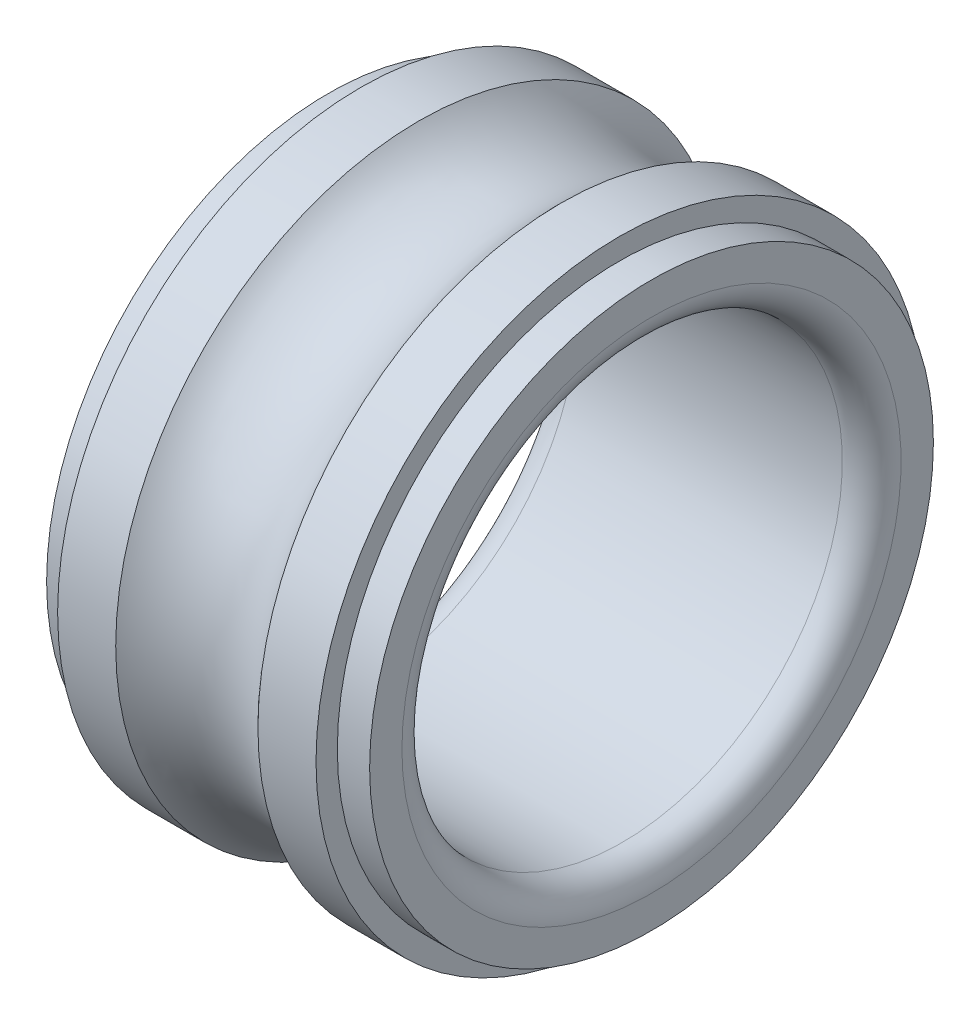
ISO-10303-21;
HEADER;
FILE_DESCRIPTION(('STEP AP214'),'2;1');
FILE_NAME('part.step','',(''),(''),'','','');
FILE_SCHEMA(('AUTOMOTIVE_DESIGN { 1 0 10303 214 1 1 1 1 }'));
ENDSEC;
DATA;
#1=APPLICATION_CONTEXT('core data for automotive mechanical design processes');
#2=APPLICATION_PROTOCOL_DEFINITION('international standard','automotive_design',2000,#1);
#3=PRODUCT_CONTEXT('',#1,'mechanical');
#4=PRODUCT('Part','Part','',(#3));
#5=PRODUCT_RELATED_PRODUCT_CATEGORY('part','',(#4));
#6=PRODUCT_DEFINITION_FORMATION('','',#4);
#7=PRODUCT_DEFINITION_CONTEXT('part definition',#1,'design');
#8=PRODUCT_DEFINITION('design','',#6,#7);
#9=PRODUCT_DEFINITION_SHAPE('','',#8);
#10=(LENGTH_UNIT() NAMED_UNIT(*) SI_UNIT(.MILLI.,.METRE.));
#11=(NAMED_UNIT(*) PLANE_ANGLE_UNIT() SI_UNIT($,.RADIAN.));
#12=(NAMED_UNIT(*) SI_UNIT($,.STERADIAN.) SOLID_ANGLE_UNIT());
#13=UNCERTAINTY_MEASURE_WITH_UNIT(LENGTH_MEASURE(1.E-05),#10,'distance_accuracy_value','');
#14=(GEOMETRIC_REPRESENTATION_CONTEXT(3) GLOBAL_UNCERTAINTY_ASSIGNED_CONTEXT((#13)) GLOBAL_UNIT_ASSIGNED_CONTEXT((#10,
#11,#12)) REPRESENTATION_CONTEXT('',''));
#15=CARTESIAN_POINT('',(0.,0.,0.));
#16=DIRECTION('',(0.,0.,1.));
#17=DIRECTION('',(1.,0.,0.));
#18=AXIS2_PLACEMENT_3D('',#15,#16,#17);
#19=CARTESIAN_POINT('',(4.4,10.325,0.));
#20=DIRECTION('',(-1.,0.,0.));
#21=DIRECTION('',(0.,0.,1.));
#22=AXIS2_PLACEMENT_3D('',#19,#20,#21);
#23=PLANE('',#22);
#24=CARTESIAN_POINT('',(4.4,0.,0.));
#25=DIRECTION('',(-1.,0.,0.));
#26=DIRECTION('',(0.,0.,1.));
#27=AXIS2_PLACEMENT_3D('',#24,#25,#26);
#28=CIRCLE('',#27,10.325);
#29=CARTESIAN_POINT('',(4.4,0.,10.325));
#30=VERTEX_POINT('',#29);
#31=EDGE_CURVE('E10',#30,#30,#28,.T.);
#32=ORIENTED_EDGE('',*,*,#31,.F.);
#33=EDGE_LOOP('',(#32));
#34=FACE_BOUND('',#33,.T.);
#35=CARTESIAN_POINT('',(4.4,0.,0.));
#36=DIRECTION('',(-1.,0.,0.));
#37=DIRECTION('',(0.,0.,1.));
#38=AXIS2_PLACEMENT_3D('',#35,#36,#37);
#39=CIRCLE('',#38,9.6);
#40=CARTESIAN_POINT('',(4.4,0.,9.6));
#41=VERTEX_POINT('',#40);
#42=EDGE_CURVE('E70',#41,#41,#39,.T.);
#43=ORIENTED_EDGE('',*,*,#42,.T.);
#44=EDGE_LOOP('',(#43));
#45=FACE_BOUND('',#44,.T.);
#46=ADVANCED_FACE('F30',(#34,#45),#23,.F.);
#47=CARTESIAN_POINT('',(-13.9748791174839,0.,0.));
#48=DIRECTION('',(-1.,0.,0.));
#49=DIRECTION('',(0.,0.,1.));
#50=AXIS2_PLACEMENT_3D('',#47,#48,#49);
#51=CYLINDRICAL_SURFACE('',#50,10.325);
#52=CARTESIAN_POINT('',(2.42165232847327,0.,0.));
#53=DIRECTION('',(-1.,0.,0.));
#54=DIRECTION('',(0.,0.,1.));
#55=AXIS2_PLACEMENT_3D('',#52,#53,#54);
#56=CIRCLE('',#55,10.325);
#57=CARTESIAN_POINT('',(2.42165232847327,0.,10.325));
#58=VERTEX_POINT('',#57);
#59=EDGE_CURVE('E36',#58,#58,#56,.T.);
#60=ORIENTED_EDGE('',*,*,#59,.F.);
#61=EDGE_LOOP('',(#60));
#62=FACE_BOUND('',#61,.T.);
#63=ORIENTED_EDGE('',*,*,#31,.T.);
#64=EDGE_LOOP('',(#63));
#65=FACE_BOUND('',#64,.T.);
#66=ADVANCED_FACE('F131',(#62,#65),#51,.T.);
#67=CARTESIAN_POINT('',(0.,0.,0.));
#68=DIRECTION('',(-1.,0.,0.));
#69=DIRECTION('',(0.,0.,1.));
#70=AXIS2_PLACEMENT_3D('',#67,#68,#69);
#71=TOROIDAL_SURFACE('',#70,12.5,3.255);
#72=CARTESIAN_POINT('',(-2.42165232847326,0.,0.));
#73=DIRECTION('',(-1.,0.,0.));
#74=DIRECTION('',(0.,0.,1.));
#75=AXIS2_PLACEMENT_3D('',#72,#73,#74);
#76=CIRCLE('',#75,10.325);
#77=CARTESIAN_POINT('',(-2.42165232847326,0.,10.325));
#78=VERTEX_POINT('',#77);
#79=EDGE_CURVE('E40',#78,#78,#76,.T.);
#80=ORIENTED_EDGE('',*,*,#79,.F.);
#81=EDGE_LOOP('',(#80));
#82=FACE_BOUND('',#81,.T.);
#83=ORIENTED_EDGE('',*,*,#59,.T.);
#84=EDGE_LOOP('',(#83));
#85=FACE_BOUND('',#84,.T.);
#86=ADVANCED_FACE('F126',(#82,#85),#71,.F.);
#87=CARTESIAN_POINT('',(-13.9748791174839,0.,0.));
#88=DIRECTION('',(-1.,0.,0.));
#89=DIRECTION('',(0.,0.,1.));
#90=AXIS2_PLACEMENT_3D('',#87,#88,#89);
#91=CYLINDRICAL_SURFACE('',#90,10.325);
#92=CARTESIAN_POINT('',(-4.4,0.,0.));
#93=DIRECTION('',(-1.,0.,0.));
#94=DIRECTION('',(0.,0.,1.));
#95=AXIS2_PLACEMENT_3D('',#92,#93,#94);
#96=CIRCLE('',#95,10.325);
#97=CARTESIAN_POINT('',(-4.4,0.,10.325));
#98=VERTEX_POINT('',#97);
#99=EDGE_CURVE('E44',#98,#98,#96,.T.);
#100=ORIENTED_EDGE('',*,*,#99,.F.);
#101=EDGE_LOOP('',(#100));
#102=FACE_BOUND('',#101,.T.);
#103=ORIENTED_EDGE('',*,*,#79,.T.);
#104=EDGE_LOOP('',(#103));
#105=FACE_BOUND('',#104,.T.);
#106=ADVANCED_FACE('F120',(#102,#105),#91,.T.);
#107=CARTESIAN_POINT('',(-4.4,10.325,0.));
#108=DIRECTION('',(1.,0.,0.));
#109=DIRECTION('',(0.,0.,-1.));
#110=AXIS2_PLACEMENT_3D('',#107,#108,#109);
#111=PLANE('',#110);
#112=CARTESIAN_POINT('',(-4.4,0.,0.));
#113=DIRECTION('',(-1.,0.,0.));
#114=DIRECTION('',(0.,0.,1.));
#115=AXIS2_PLACEMENT_3D('',#112,#113,#114);
#116=CIRCLE('',#115,9.6);
#117=CARTESIAN_POINT('',(-4.4,0.,9.6));
#118=VERTEX_POINT('',#117);
#119=EDGE_CURVE('E49',#118,#118,#116,.T.);
#120=ORIENTED_EDGE('',*,*,#119,.F.);
#121=EDGE_LOOP('',(#120));
#122=FACE_BOUND('',#121,.T.);
#123=ORIENTED_EDGE('',*,*,#99,.T.);
#124=EDGE_LOOP('',(#123));
#125=FACE_BOUND('',#124,.T.);
#126=ADVANCED_FACE('F114',(#122,#125),#111,.F.);
#127=CARTESIAN_POINT('',(-13.9748791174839,0.,0.));
#128=DIRECTION('',(-1.,0.,0.));
#129=DIRECTION('',(0.,0.,1.));
#130=AXIS2_PLACEMENT_3D('',#127,#128,#129);
#131=CYLINDRICAL_SURFACE('',#130,9.6);
#132=CARTESIAN_POINT('',(-5.5,0.,0.));
#133=DIRECTION('',(-1.,0.,0.));
#134=DIRECTION('',(0.,0.,1.));
#135=AXIS2_PLACEMENT_3D('',#132,#133,#134);
#136=CIRCLE('',#135,9.6);
#137=CARTESIAN_POINT('',(-5.5,0.,9.6));
#138=VERTEX_POINT('',#137);
#139=EDGE_CURVE('E52',#138,#138,#136,.T.);
#140=ORIENTED_EDGE('',*,*,#139,.F.);
#141=EDGE_LOOP('',(#140));
#142=FACE_BOUND('',#141,.T.);
#143=ORIENTED_EDGE('',*,*,#119,.T.);
#144=EDGE_LOOP('',(#143));
#145=FACE_BOUND('',#144,.T.);
#146=ADVANCED_FACE('F108',(#142,#145),#131,.T.);
#147=CARTESIAN_POINT('',(-5.5,9.6,0.));
#148=DIRECTION('',(1.,0.,0.));
#149=DIRECTION('',(0.,0.,-1.));
#150=AXIS2_PLACEMENT_3D('',#147,#148,#149);
#151=PLANE('',#150);
#152=CARTESIAN_POINT('',(-5.5,0.,0.));
#153=DIRECTION('',(-1.,0.,0.));
#154=DIRECTION('',(0.,0.,1.));
#155=AXIS2_PLACEMENT_3D('',#152,#153,#154);
#156=CIRCLE('',#155,8.50000000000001);
#157=CARTESIAN_POINT('',(-5.5,0.,8.50000000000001));
#158=VERTEX_POINT('',#157);
#159=EDGE_CURVE('E55',#158,#158,#156,.T.);
#160=ORIENTED_EDGE('',*,*,#159,.F.);
#161=EDGE_LOOP('',(#160));
#162=FACE_BOUND('',#161,.T.);
#163=ORIENTED_EDGE('',*,*,#139,.T.);
#164=EDGE_LOOP('',(#163));
#165=FACE_BOUND('',#164,.T.);
#166=ADVANCED_FACE('F102',(#162,#165),#151,.F.);
#167=CARTESIAN_POINT('',(-4.5,0.,0.));
#168=DIRECTION('',(-1.,0.,0.));
#169=DIRECTION('',(0.,0.,1.));
#170=AXIS2_PLACEMENT_3D('',#167,#168,#169);
#171=TOROIDAL_SURFACE('',#170,8.5,1.);
#172=CARTESIAN_POINT('',(-4.49999999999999,0.,0.));
#173=DIRECTION('',(-1.,0.,0.));
#174=DIRECTION('',(0.,0.,1.));
#175=AXIS2_PLACEMENT_3D('',#172,#173,#174);
#176=CIRCLE('',#175,7.5);
#177=CARTESIAN_POINT('',(-4.49999999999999,0.,7.5));
#178=VERTEX_POINT('',#177);
#179=EDGE_CURVE('E58',#178,#178,#176,.T.);
#180=ORIENTED_EDGE('',*,*,#179,.F.);
#181=EDGE_LOOP('',(#180));
#182=FACE_BOUND('',#181,.T.);
#183=ORIENTED_EDGE('',*,*,#159,.T.);
#184=EDGE_LOOP('',(#183));
#185=FACE_BOUND('',#184,.T.);
#186=ADVANCED_FACE('F96',(#182,#185),#171,.T.);
#187=CARTESIAN_POINT('',(-13.9748791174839,0.,0.));
#188=DIRECTION('',(-1.,0.,0.));
#189=DIRECTION('',(0.,0.,1.));
#190=AXIS2_PLACEMENT_3D('',#187,#188,#189);
#191=CYLINDRICAL_SURFACE('',#190,7.5);
#192=CARTESIAN_POINT('',(4.5,0.,0.));
#193=DIRECTION('',(-1.,0.,0.));
#194=DIRECTION('',(0.,0.,1.));
#195=AXIS2_PLACEMENT_3D('',#192,#193,#194);
#196=CIRCLE('',#195,7.5);
#197=CARTESIAN_POINT('',(4.5,0.,7.5));
#198=VERTEX_POINT('',#197);
#199=EDGE_CURVE('E61',#198,#198,#196,.T.);
#200=ORIENTED_EDGE('',*,*,#199,.F.);
#201=EDGE_LOOP('',(#200));
#202=FACE_BOUND('',#201,.T.);
#203=ORIENTED_EDGE('',*,*,#179,.T.);
#204=EDGE_LOOP('',(#203));
#205=FACE_BOUND('',#204,.T.);
#206=ADVANCED_FACE('F90',(#202,#205),#191,.F.);
#207=CARTESIAN_POINT('',(4.5,0.,0.));
#208=DIRECTION('',(-1.,0.,0.));
#209=DIRECTION('',(0.,0.,1.));
#210=AXIS2_PLACEMENT_3D('',#207,#208,#209);
#211=TOROIDAL_SURFACE('',#210,8.5,1.);
#212=CARTESIAN_POINT('',(5.50000000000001,0.,0.));
#213=DIRECTION('',(-1.,0.,0.));
#214=DIRECTION('',(0.,0.,1.));
#215=AXIS2_PLACEMENT_3D('',#212,#213,#214);
#216=CIRCLE('',#215,8.50000000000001);
#217=CARTESIAN_POINT('',(5.50000000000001,0.,8.50000000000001));
#218=VERTEX_POINT('',#217);
#219=EDGE_CURVE('E64',#218,#218,#216,.T.);
#220=ORIENTED_EDGE('',*,*,#219,.F.);
#221=EDGE_LOOP('',(#220));
#222=FACE_BOUND('',#221,.T.);
#223=ORIENTED_EDGE('',*,*,#199,.T.);
#224=EDGE_LOOP('',(#223));
#225=FACE_BOUND('',#224,.T.);
#226=ADVANCED_FACE('F84',(#222,#225),#211,.T.);
#227=CARTESIAN_POINT('',(5.5,9.6,0.));
#228=DIRECTION('',(-1.,0.,0.));
#229=DIRECTION('',(0.,0.,1.));
#230=AXIS2_PLACEMENT_3D('',#227,#228,#229);
#231=PLANE('',#230);
#232=CARTESIAN_POINT('',(5.5,0.,0.));
#233=DIRECTION('',(-1.,0.,0.));
#234=DIRECTION('',(0.,0.,1.));
#235=AXIS2_PLACEMENT_3D('',#232,#233,#234);
#236=CIRCLE('',#235,9.6);
#237=CARTESIAN_POINT('',(5.5,0.,9.6));
#238=VERTEX_POINT('',#237);
#239=EDGE_CURVE('E67',#238,#238,#236,.T.);
#240=ORIENTED_EDGE('',*,*,#239,.F.);
#241=EDGE_LOOP('',(#240));
#242=FACE_BOUND('',#241,.T.);
#243=ORIENTED_EDGE('',*,*,#219,.T.);
#244=EDGE_LOOP('',(#243));
#245=FACE_BOUND('',#244,.T.);
#246=ADVANCED_FACE('F78',(#242,#245),#231,.F.);
#247=CARTESIAN_POINT('',(-13.9748791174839,0.,0.));
#248=DIRECTION('',(-1.,0.,0.));
#249=DIRECTION('',(0.,0.,1.));
#250=AXIS2_PLACEMENT_3D('',#247,#248,#249);
#251=CYLINDRICAL_SURFACE('',#250,9.6);
#252=ORIENTED_EDGE('',*,*,#42,.F.);
#253=EDGE_LOOP('',(#252));
#254=FACE_BOUND('',#253,.T.);
#255=ORIENTED_EDGE('',*,*,#239,.T.);
#256=EDGE_LOOP('',(#255));
#257=FACE_BOUND('',#256,.T.);
#258=ADVANCED_FACE('F75',(#254,#257),#251,.T.);
#259=CLOSED_SHELL('',(#46,#66,#86,#106,#126,#146,#166,#186,#206,#226,#246,#258));
#260=MANIFOLD_SOLID_BREP('B2',#259);
#261=ADVANCED_BREP_SHAPE_REPRESENTATION('',(#18,#260),#14);
#262=SHAPE_DEFINITION_REPRESENTATION(#9,#261);
ENDSEC;
END-ISO-10303-21;
